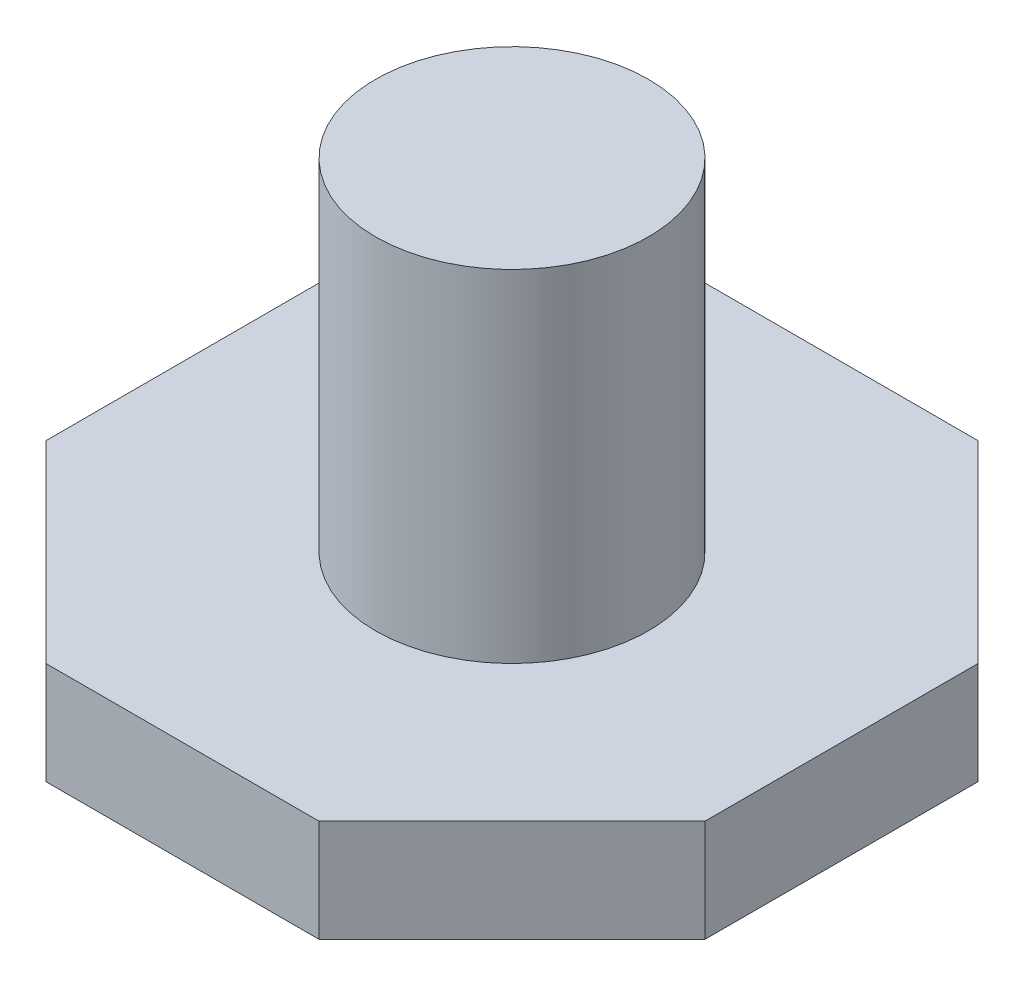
from build123d import *

# Parameters (mm, degrees)
EXTRUDE_1_DEPTH = 1.5
EXTRUDE_START   = 1.5
SKETCH_1_4_R    = 2
EXTRUDE_2_DEPTH = 5


with BuildPart() as part:
    # Sketch 1 → Extrude 1 (new body)
    with BuildSketch(Plane(origin=(0, 0, 0), x_dir=(1, 0, 0), z_dir=(0, 1, 0))):
        Polygon((-2, 4.828427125), (-4.828427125, 2), (-4.828427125, -2), (-2, -4.828427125), (2, -4.828427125), (4.828427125, -2), (4.828427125, 2), (2, 4.828427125), align=None)
    extrude(amount=EXTRUDE_1_DEPTH)

    # Sketch 1_4 → Extrude 2 (add)
    with BuildSketch(Plane(origin=(0, 0, 0), x_dir=(1, 0, 0), z_dir=(0, 1, 0)).offset(EXTRUDE_START)):
        with Locations(Location((0, 0, 0), (0, 0, 270))):
            Circle(SKETCH_1_4_R)
    extrude(amount=EXTRUDE_2_DEPTH)


solid = part.part
